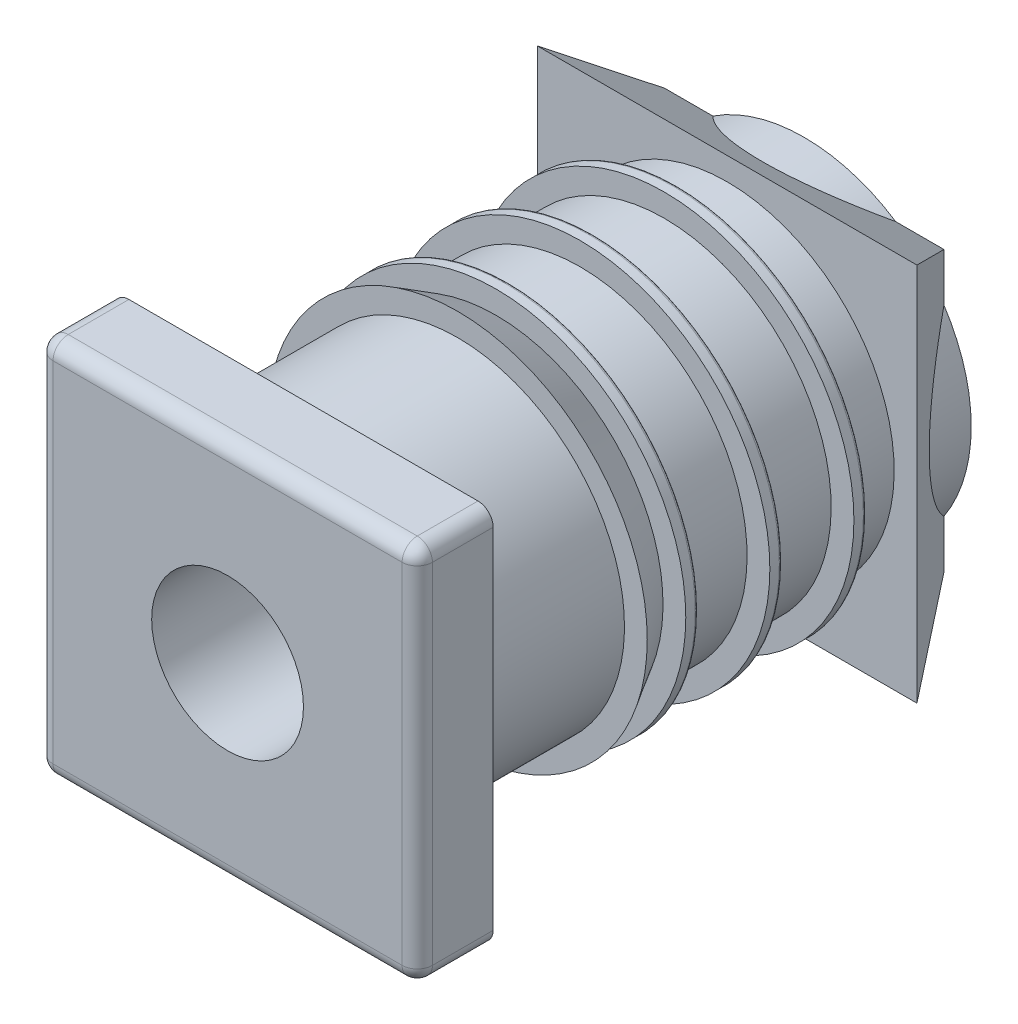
ISO-10303-21;
HEADER;
FILE_DESCRIPTION(('STEP AP214'),'2;1');
FILE_NAME('part.step','',(''),(''),'','','');
FILE_SCHEMA(('AUTOMOTIVE_DESIGN { 1 0 10303 214 1 1 1 1 }'));
ENDSEC;
DATA;
#1=APPLICATION_CONTEXT('core data for automotive mechanical design processes');
#2=APPLICATION_PROTOCOL_DEFINITION('international standard','automotive_design',2000,#1);
#3=PRODUCT_CONTEXT('',#1,'mechanical');
#4=PRODUCT('Part','Part','',(#3));
#5=PRODUCT_RELATED_PRODUCT_CATEGORY('part','',(#4));
#6=PRODUCT_DEFINITION_FORMATION('','',#4);
#7=PRODUCT_DEFINITION_CONTEXT('part definition',#1,'design');
#8=PRODUCT_DEFINITION('design','',#6,#7);
#9=PRODUCT_DEFINITION_SHAPE('','',#8);
#10=(LENGTH_UNIT() NAMED_UNIT(*) SI_UNIT(.MILLI.,.METRE.));
#11=(NAMED_UNIT(*) PLANE_ANGLE_UNIT() SI_UNIT($,.RADIAN.));
#12=(NAMED_UNIT(*) SI_UNIT($,.STERADIAN.) SOLID_ANGLE_UNIT());
#13=UNCERTAINTY_MEASURE_WITH_UNIT(LENGTH_MEASURE(1.E-05),#10,'distance_accuracy_value','');
#14=(GEOMETRIC_REPRESENTATION_CONTEXT(3) GLOBAL_UNCERTAINTY_ASSIGNED_CONTEXT((#13)) GLOBAL_UNIT_ASSIGNED_CONTEXT((#10,
#11,#12)) REPRESENTATION_CONTEXT('',''));
#15=CARTESIAN_POINT('',(0.,0.,0.));
#16=DIRECTION('',(0.,0.,1.));
#17=DIRECTION('',(1.,0.,0.));
#18=AXIS2_PLACEMENT_3D('',#15,#16,#17);
#19=CARTESIAN_POINT('',(-11.65,0.,-19.0565934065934));
#20=DIRECTION('',(0.,0.,-1.));
#21=DIRECTION('',(0.,-1.,0.));
#22=AXIS2_PLACEMENT_3D('',#19,#20,#21);
#23=PLANE('',#22);
#24=CARTESIAN_POINT('',(0.,0.,-19.0565934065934));
#25=DIRECTION('',(0.,0.,1.));
#26=DIRECTION('',(0.,-1.,0.));
#27=AXIS2_PLACEMENT_3D('',#24,#25,#26);
#28=CIRCLE('',#27,12.3);
#29=CARTESIAN_POINT('',(0.,-12.3,-19.0565934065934));
#30=VERTEX_POINT('',#29);
#31=CARTESIAN_POINT('',(0.,12.3,-19.0565934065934));
#32=VERTEX_POINT('',#31);
#33=EDGE_CURVE('E178',#30,#32,#28,.T.);
#34=ORIENTED_EDGE('',*,*,#33,.F.);
#35=CARTESIAN_POINT('',(0.,0.,-19.0565934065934));
#36=DIRECTION('',(0.,0.,1.));
#37=DIRECTION('',(-1.,0.,0.));
#38=AXIS2_PLACEMENT_3D('',#35,#36,#37);
#39=CIRCLE('',#38,12.3);
#40=CARTESIAN_POINT('',(-12.3,0.,-19.0565934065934));
#41=VERTEX_POINT('',#40);
#42=EDGE_CURVE('E171',#41,#30,#39,.T.);
#43=ORIENTED_EDGE('',*,*,#42,.F.);
#44=CARTESIAN_POINT('',(0.,0.,-19.0565934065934));
#45=DIRECTION('',(0.,0.,1.));
#46=DIRECTION('',(0.,1.,0.));
#47=AXIS2_PLACEMENT_3D('',#44,#45,#46);
#48=CIRCLE('',#47,12.3);
#49=EDGE_CURVE('E175',#32,#41,#48,.T.);
#50=ORIENTED_EDGE('',*,*,#49,.F.);
#51=EDGE_LOOP('',(#34,#43,#50));
#52=FACE_BOUND('',#51,.T.);
#53=CARTESIAN_POINT('',(0.,0.,-19.0565934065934));
#54=DIRECTION('',(0.,0.,1.));
#55=DIRECTION('',(0.,1.,0.));
#56=AXIS2_PLACEMENT_3D('',#53,#54,#55);
#57=CIRCLE('',#56,11.);
#58=CARTESIAN_POINT('',(0.,11.,-19.0565934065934));
#59=VERTEX_POINT('',#58);
#60=EDGE_CURVE('E188',#59,#59,#57,.F.);
#61=ORIENTED_EDGE('',*,*,#60,.F.);
#62=EDGE_LOOP('',(#61));
#63=FACE_BOUND('',#62,.T.);
#64=ADVANCED_FACE('F14',(#52,#63),#23,.T.);
#65=CARTESIAN_POINT('',(0.,0.,-21.4137362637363));
#66=DIRECTION('',(0.,0.,1.));
#67=DIRECTION('',(0.,1.,0.));
#68=AXIS2_PLACEMENT_3D('',#65,#66,#67);
#69=CYLINDRICAL_SURFACE('',#68,11.);
#70=CARTESIAN_POINT('',(0.,0.,-23.7708791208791));
#71=DIRECTION('',(0.,0.,1.));
#72=DIRECTION('',(0.,1.,0.));
#73=AXIS2_PLACEMENT_3D('',#70,#71,#72);
#74=CIRCLE('',#73,11.);
#75=CARTESIAN_POINT('',(0.,11.,-23.7708791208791));
#76=VERTEX_POINT('',#75);
#77=EDGE_CURVE('E339',#76,#76,#74,.F.);
#78=ORIENTED_EDGE('',*,*,#77,.F.);
#79=EDGE_LOOP('',(#78));
#80=FACE_BOUND('',#79,.T.);
#81=ORIENTED_EDGE('',*,*,#60,.T.);
#82=EDGE_LOOP('',(#81));
#83=FACE_BOUND('',#82,.T.);
#84=ADVANCED_FACE('F210',(#80,#83),#69,.T.);
#85=CARTESIAN_POINT('',(0.,0.,-18.8565934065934));
#86=DIRECTION('',(0.,0.,-1.));
#87=DIRECTION('',(0.,-1.,0.));
#88=AXIS2_PLACEMENT_3D('',#85,#86,#87);
#89=TOROIDAL_SURFACE('',#88,12.3,0.2);
#90=ORIENTED_EDGE('',*,*,#42,.T.);
#91=ORIENTED_EDGE('',*,*,#33,.T.);
#92=ORIENTED_EDGE('',*,*,#49,.T.);
#93=EDGE_LOOP('',(#90,#91,#92));
#94=FACE_BOUND('',#93,.T.);
#95=CARTESIAN_POINT('',(0.,0.,-18.8565934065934));
#96=DIRECTION('',(0.,0.,1.));
#97=DIRECTION('',(0.,1.,0.));
#98=AXIS2_PLACEMENT_3D('',#95,#96,#97);
#99=CIRCLE('',#98,12.5);
#100=CARTESIAN_POINT('',(0.,12.5,-18.8565934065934));
#101=VERTEX_POINT('',#100);
#102=EDGE_CURVE('E218',#101,#101,#99,.T.);
#103=ORIENTED_EDGE('',*,*,#102,.F.);
#104=EDGE_LOOP('',(#103));
#105=FACE_BOUND('',#104,.T.);
#106=ADVANCED_FACE('F185',(#94,#105),#89,.T.);
#107=CARTESIAN_POINT('',(-11.75,0.,-23.7708791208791));
#108=DIRECTION('',(0.,0.,1.));
#109=DIRECTION('',(0.,1.,0.));
#110=AXIS2_PLACEMENT_3D('',#107,#108,#109);
#111=PLANE('',#110);
#112=ORIENTED_EDGE('',*,*,#77,.T.);
#113=EDGE_LOOP('',(#112));
#114=FACE_BOUND('',#113,.T.);
#115=CARTESIAN_POINT('',(0.,0.,-23.7708791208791));
#116=DIRECTION('',(0.,0.,1.));
#117=DIRECTION('',(0.,1.,0.));
#118=AXIS2_PLACEMENT_3D('',#115,#116,#117);
#119=CIRCLE('',#118,12.5);
#120=CARTESIAN_POINT('',(0.,12.5,-23.7708791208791));
#121=VERTEX_POINT('',#120);
#122=EDGE_CURVE('E336',#121,#121,#119,.F.);
#123=ORIENTED_EDGE('',*,*,#122,.F.);
#124=EDGE_LOOP('',(#123));
#125=FACE_BOUND('',#124,.T.);
#126=ADVANCED_FACE('F209',(#114,#125),#111,.T.);
#127=CARTESIAN_POINT('',(0.,0.,-18.5440934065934));
#128=DIRECTION('',(0.,0.,1.));
#129=DIRECTION('',(0.,1.,0.));
#130=AXIS2_PLACEMENT_3D('',#127,#128,#129);
#131=CYLINDRICAL_SURFACE('',#130,12.5);
#132=ORIENTED_EDGE('',*,*,#102,.T.);
#133=EDGE_LOOP('',(#132));
#134=FACE_BOUND('',#133,.T.);
#135=CARTESIAN_POINT('',(0.,0.,-18.2315934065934));
#136=DIRECTION('',(0.,0.,1.));
#137=DIRECTION('',(0.,1.,0.));
#138=AXIS2_PLACEMENT_3D('',#135,#136,#137);
#139=CIRCLE('',#138,12.5);
#140=CARTESIAN_POINT('',(0.,12.5,-18.2315934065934));
#141=VERTEX_POINT('',#140);
#142=EDGE_CURVE('E333',#141,#141,#139,.T.);
#143=ORIENTED_EDGE('',*,*,#142,.F.);
#144=EDGE_LOOP('',(#143));
#145=FACE_BOUND('',#144,.T.);
#146=ADVANCED_FACE('F482',(#134,#145),#131,.T.);
#147=CARTESIAN_POINT('',(0.,0.,-24.0833791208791));
#148=DIRECTION('',(0.,0.,1.));
#149=DIRECTION('',(0.,1.,0.));
#150=AXIS2_PLACEMENT_3D('',#147,#148,#149);
#151=CYLINDRICAL_SURFACE('',#150,12.5);
#152=ORIENTED_EDGE('',*,*,#122,.T.);
#153=EDGE_LOOP('',(#152));
#154=FACE_BOUND('',#153,.T.);
#155=CARTESIAN_POINT('',(0.,0.,-24.3958791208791));
#156=DIRECTION('',(0.,0.,-1.));
#157=DIRECTION('',(0.,-1.,0.));
#158=AXIS2_PLACEMENT_3D('',#155,#156,#157);
#159=CIRCLE('',#158,12.5);
#160=CARTESIAN_POINT('',(0.,-12.5,-24.3958791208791));
#161=VERTEX_POINT('',#160);
#162=EDGE_CURVE('E332',#161,#161,#159,.T.);
#163=ORIENTED_EDGE('',*,*,#162,.F.);
#164=EDGE_LOOP('',(#163));
#165=FACE_BOUND('',#164,.T.);
#166=ADVANCED_FACE('F480',(#154,#165),#151,.T.);
#167=CARTESIAN_POINT('',(-11.75,0.,-18.2315934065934));
#168=DIRECTION('',(0.,0.,1.));
#169=DIRECTION('',(0.,1.,0.));
#170=AXIS2_PLACEMENT_3D('',#167,#168,#169);
#171=PLANE('',#170);
#172=CARTESIAN_POINT('',(0.,0.,-18.2315934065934));
#173=DIRECTION('',(0.,0.,1.));
#174=DIRECTION('',(0.,1.,0.));
#175=AXIS2_PLACEMENT_3D('',#172,#173,#174);
#176=CIRCLE('',#175,11.);
#177=CARTESIAN_POINT('',(0.,11.,-18.2315934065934));
#178=VERTEX_POINT('',#177);
#179=EDGE_CURVE('E328',#178,#178,#176,.T.);
#180=ORIENTED_EDGE('',*,*,#179,.F.);
#181=EDGE_LOOP('',(#180));
#182=FACE_BOUND('',#181,.T.);
#183=ORIENTED_EDGE('',*,*,#142,.T.);
#184=EDGE_LOOP('',(#183));
#185=FACE_BOUND('',#184,.T.);
#186=ADVANCED_FACE('F460',(#182,#185),#171,.T.);
#187=CARTESIAN_POINT('',(0.,0.,-24.3958791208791));
#188=DIRECTION('',(0.,0.,-1.));
#189=DIRECTION('',(0.,-1.,0.));
#190=AXIS2_PLACEMENT_3D('',#187,#188,#189);
#191=TOROIDAL_SURFACE('',#190,12.3,0.2);
#192=ORIENTED_EDGE('',*,*,#162,.T.);
#193=EDGE_LOOP('',(#192));
#194=FACE_BOUND('',#193,.T.);
#195=CARTESIAN_POINT('',(0.,0.,-24.5958791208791));
#196=DIRECTION('',(0.,0.,1.));
#197=DIRECTION('',(0.,1.,0.));
#198=AXIS2_PLACEMENT_3D('',#195,#196,#197);
#199=CIRCLE('',#198,12.3);
#200=CARTESIAN_POINT('',(-12.3,0.,-24.5958791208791));
#201=VERTEX_POINT('',#200);
#202=CARTESIAN_POINT('',(0.,12.3,-24.5958791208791));
#203=VERTEX_POINT('',#202);
#204=EDGE_CURVE('E331',#201,#203,#199,.F.);
#205=ORIENTED_EDGE('',*,*,#204,.F.);
#206=CARTESIAN_POINT('',(0.,0.,-24.5958791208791));
#207=DIRECTION('',(0.,0.,1.));
#208=DIRECTION('',(-1.,0.,0.));
#209=AXIS2_PLACEMENT_3D('',#206,#207,#208);
#210=CIRCLE('',#209,12.3);
#211=CARTESIAN_POINT('',(0.,-12.3,-24.5958791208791));
#212=VERTEX_POINT('',#211);
#213=EDGE_CURVE('E327',#212,#201,#210,.F.);
#214=ORIENTED_EDGE('',*,*,#213,.F.);
#215=CARTESIAN_POINT('',(0.,0.,-24.5958791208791));
#216=DIRECTION('',(0.,0.,1.));
#217=DIRECTION('',(0.,-1.,0.));
#218=AXIS2_PLACEMENT_3D('',#215,#216,#217);
#219=CIRCLE('',#218,12.3);
#220=EDGE_CURVE('E434',#203,#212,#219,.F.);
#221=ORIENTED_EDGE('',*,*,#220,.F.);
#222=EDGE_LOOP('',(#205,#214,#221));
#223=FACE_BOUND('',#222,.T.);
#224=ADVANCED_FACE('F455',(#194,#223),#191,.T.);
#225=CARTESIAN_POINT('',(0.,0.,-15.8744505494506));
#226=DIRECTION('',(0.,0.,1.));
#227=DIRECTION('',(0.,1.,0.));
#228=AXIS2_PLACEMENT_3D('',#225,#226,#227);
#229=CYLINDRICAL_SURFACE('',#228,11.);
#230=ORIENTED_EDGE('',*,*,#179,.T.);
#231=EDGE_LOOP('',(#230));
#232=FACE_BOUND('',#231,.T.);
#233=CARTESIAN_POINT('',(0.,0.,-13.5173076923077));
#234=DIRECTION('',(0.,0.,1.));
#235=DIRECTION('',(0.,1.,0.));
#236=AXIS2_PLACEMENT_3D('',#233,#234,#235);
#237=CIRCLE('',#236,11.);
#238=CARTESIAN_POINT('',(0.,11.,-13.5173076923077));
#239=VERTEX_POINT('',#238);
#240=EDGE_CURVE('E324',#239,#239,#237,.T.);
#241=ORIENTED_EDGE('',*,*,#240,.F.);
#242=EDGE_LOOP('',(#241));
#243=FACE_BOUND('',#242,.T.);
#244=ADVANCED_FACE('F459',(#232,#243),#229,.T.);
#245=CARTESIAN_POINT('',(-11.65,0.,-24.5958791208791));
#246=DIRECTION('',(0.,0.,-1.));
#247=DIRECTION('',(0.,-1.,0.));
#248=AXIS2_PLACEMENT_3D('',#245,#246,#247);
#249=PLANE('',#248);
#250=ORIENTED_EDGE('',*,*,#220,.T.);
#251=ORIENTED_EDGE('',*,*,#213,.T.);
#252=ORIENTED_EDGE('',*,*,#204,.T.);
#253=EDGE_LOOP('',(#250,#251,#252));
#254=FACE_BOUND('',#253,.T.);
#255=CARTESIAN_POINT('',(0.,0.,-24.5958791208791));
#256=DIRECTION('',(0.,0.,1.));
#257=DIRECTION('',(0.,1.,0.));
#258=AXIS2_PLACEMENT_3D('',#255,#256,#257);
#259=CIRCLE('',#258,11.);
#260=CARTESIAN_POINT('',(0.,11.,-24.5958791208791));
#261=VERTEX_POINT('',#260);
#262=EDGE_CURVE('E320',#261,#261,#259,.F.);
#263=ORIENTED_EDGE('',*,*,#262,.F.);
#264=EDGE_LOOP('',(#263));
#265=FACE_BOUND('',#264,.T.);
#266=ADVANCED_FACE('F392',(#254,#265),#249,.T.);
#267=CARTESIAN_POINT('',(-11.65,0.,-13.5173076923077));
#268=DIRECTION('',(0.,0.,-1.));
#269=DIRECTION('',(0.,-1.,0.));
#270=AXIS2_PLACEMENT_3D('',#267,#268,#269);
#271=PLANE('',#270);
#272=CARTESIAN_POINT('',(0.,0.,-13.5173076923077));
#273=DIRECTION('',(0.,0.,1.));
#274=DIRECTION('',(0.,-1.,0.));
#275=AXIS2_PLACEMENT_3D('',#272,#273,#274);
#276=CIRCLE('',#275,12.3);
#277=CARTESIAN_POINT('',(0.,-12.3,-13.5173076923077));
#278=VERTEX_POINT('',#277);
#279=CARTESIAN_POINT('',(0.,12.3,-13.5173076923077));
#280=VERTEX_POINT('',#279);
#281=EDGE_CURVE('E319',#278,#280,#276,.T.);
#282=ORIENTED_EDGE('',*,*,#281,.F.);
#283=CARTESIAN_POINT('',(0.,0.,-13.5173076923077));
#284=DIRECTION('',(0.,0.,1.));
#285=DIRECTION('',(-1.,0.,0.));
#286=AXIS2_PLACEMENT_3D('',#283,#284,#285);
#287=CIRCLE('',#286,12.3);
#288=CARTESIAN_POINT('',(-12.3,0.,-13.5173076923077));
#289=VERTEX_POINT('',#288);
#290=EDGE_CURVE('E409',#289,#278,#287,.T.);
#291=ORIENTED_EDGE('',*,*,#290,.F.);
#292=CARTESIAN_POINT('',(0.,0.,-13.5173076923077));
#293=DIRECTION('',(0.,0.,1.));
#294=DIRECTION('',(0.,1.,0.));
#295=AXIS2_PLACEMENT_3D('',#292,#293,#294);
#296=CIRCLE('',#295,12.3);
#297=EDGE_CURVE('E323',#280,#289,#296,.T.);
#298=ORIENTED_EDGE('',*,*,#297,.F.);
#299=EDGE_LOOP('',(#282,#291,#298));
#300=FACE_BOUND('',#299,.T.);
#301=ORIENTED_EDGE('',*,*,#240,.T.);
#302=EDGE_LOOP('',(#301));
#303=FACE_BOUND('',#302,.T.);
#304=ADVANCED_FACE('F383',(#300,#303),#271,.T.);
#305=CARTESIAN_POINT('',(0.,0.,-28.7979395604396));
#306=DIRECTION('',(0.,0.,1.));
#307=DIRECTION('',(0.,1.,0.));
#308=AXIS2_PLACEMENT_3D('',#305,#306,#307);
#309=CYLINDRICAL_SURFACE('',#308,11.);
#310=ORIENTED_EDGE('',*,*,#262,.T.);
#311=EDGE_LOOP('',(#310));
#312=FACE_BOUND('',#311,.T.);
#313=CARTESIAN_POINT('',(0.,0.,-27.9230769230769));
#314=DIRECTION('',(0.,0.,1.));
#315=DIRECTION('',(0.,1.,0.));
#316=AXIS2_PLACEMENT_3D('',#313,#314,#315);
#317=CIRCLE('',#316,11.);
#318=CARTESIAN_POINT('',(0.,11.,-27.9230769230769));
#319=VERTEX_POINT('',#318);
#320=EDGE_CURVE('E315',#319,#319,#317,.F.);
#321=ORIENTED_EDGE('',*,*,#320,.F.);
#322=EDGE_LOOP('',(#321));
#323=FACE_BOUND('',#322,.T.);
#324=ADVANCED_FACE('F366',(#312,#323),#309,.T.);
#325=CARTESIAN_POINT('',(0.,0.,-13.3173076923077));
#326=DIRECTION('',(0.,0.,-1.));
#327=DIRECTION('',(0.,-1.,0.));
#328=AXIS2_PLACEMENT_3D('',#325,#326,#327);
#329=TOROIDAL_SURFACE('',#328,12.3,0.2);
#330=ORIENTED_EDGE('',*,*,#290,.T.);
#331=ORIENTED_EDGE('',*,*,#281,.T.);
#332=ORIENTED_EDGE('',*,*,#297,.T.);
#333=EDGE_LOOP('',(#330,#331,#332));
#334=FACE_BOUND('',#333,.T.);
#335=CARTESIAN_POINT('',(0.,0.,-13.3173076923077));
#336=DIRECTION('',(0.,0.,1.));
#337=DIRECTION('',(0.,1.,0.));
#338=AXIS2_PLACEMENT_3D('',#335,#336,#337);
#339=CIRCLE('',#338,12.5);
#340=CARTESIAN_POINT('',(0.,12.5,-13.3173076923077));
#341=VERTEX_POINT('',#340);
#342=EDGE_CURVE('E318',#341,#341,#339,.T.);
#343=ORIENTED_EDGE('',*,*,#342,.F.);
#344=EDGE_LOOP('',(#343));
#345=FACE_BOUND('',#344,.T.);
#346=ADVANCED_FACE('F354',(#334,#345),#329,.T.);
#347=CARTESIAN_POINT('',(12.5,-12.5,-27.9230769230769));
#348=DIRECTION('',(0.,0.,1.));
#349=DIRECTION('',(0.,1.,0.));
#350=AXIS2_PLACEMENT_3D('',#347,#348,#349);
#351=PLANE('',#350);
#352=DIRECTION('',(-1.,0.,0.));
#353=VECTOR('',#352,1.);
#354=CARTESIAN_POINT('',(-12.5,-12.5,-27.9230769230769));
#355=LINE('',#354,#353);
#356=CARTESIAN_POINT('',(-12.5,-12.5,-27.9230769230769));
#357=VERTEX_POINT('',#356);
#358=CARTESIAN_POINT('',(12.5,-12.5,-27.9230769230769));
#359=VERTEX_POINT('',#358);
#360=EDGE_CURVE('E314',#357,#359,#355,.F.);
#361=ORIENTED_EDGE('',*,*,#360,.T.);
#362=DIRECTION('',(0.,-1.,0.));
#363=VECTOR('',#362,1.);
#364=CARTESIAN_POINT('',(12.5,-12.5,-27.9230769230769));
#365=LINE('',#364,#363);
#366=CARTESIAN_POINT('',(12.5,12.5,-27.9230769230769));
#367=VERTEX_POINT('',#366);
#368=EDGE_CURVE('E621',#367,#359,#365,.T.);
#369=ORIENTED_EDGE('',*,*,#368,.F.);
#370=DIRECTION('',(-1.,0.,0.));
#371=VECTOR('',#370,1.);
#372=CARTESIAN_POINT('',(-12.5,12.5,-27.9230769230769));
#373=LINE('',#372,#371);
#374=CARTESIAN_POINT('',(-12.5,12.5,-27.9230769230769));
#375=VERTEX_POINT('',#374);
#376=EDGE_CURVE('E623',#367,#375,#373,.T.);
#377=ORIENTED_EDGE('',*,*,#376,.T.);
#378=DIRECTION('',(0.,-1.,0.));
#379=VECTOR('',#378,1.);
#380=CARTESIAN_POINT('',(-12.5,-12.5,-27.9230769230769));
#381=LINE('',#380,#379);
#382=EDGE_CURVE('E624',#357,#375,#381,.F.);
#383=ORIENTED_EDGE('',*,*,#382,.F.);
#384=EDGE_LOOP('',(#361,#369,#377,#383));
#385=FACE_BOUND('',#384,.T.);
#386=ORIENTED_EDGE('',*,*,#320,.T.);
#387=EDGE_LOOP('',(#386));
#388=FACE_BOUND('',#387,.T.);
#389=ADVANCED_FACE('F365',(#385,#388),#351,.T.);
#390=CARTESIAN_POINT('',(0.,0.,-13.0048076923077));
#391=DIRECTION('',(0.,0.,1.));
#392=DIRECTION('',(0.,1.,0.));
#393=AXIS2_PLACEMENT_3D('',#390,#391,#392);
#394=CYLINDRICAL_SURFACE('',#393,12.5);
#395=ORIENTED_EDGE('',*,*,#342,.T.);
#396=EDGE_LOOP('',(#395));
#397=FACE_BOUND('',#396,.T.);
#398=CARTESIAN_POINT('',(0.,0.,-12.6923076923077));
#399=DIRECTION('',(0.,0.,1.));
#400=DIRECTION('',(0.,1.,0.));
#401=AXIS2_PLACEMENT_3D('',#398,#399,#400);
#402=CIRCLE('',#401,12.5);
#403=CARTESIAN_POINT('',(0.,12.5,-12.6923076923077));
#404=VERTEX_POINT('',#403);
#405=EDGE_CURVE('E298',#404,#404,#402,.T.);
#406=ORIENTED_EDGE('',*,*,#405,.F.);
#407=EDGE_LOOP('',(#406));
#408=FACE_BOUND('',#407,.T.);
#409=ADVANCED_FACE('F602',(#397,#408),#394,.T.);
#410=CARTESIAN_POINT('',(0.,0.,-28.7979395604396));
#411=DIRECTION('',(0.,0.,1.));
#412=DIRECTION('',(0.,1.,0.));
#413=AXIS2_PLACEMENT_3D('',#410,#411,#412);
#414=CYLINDRICAL_SURFACE('',#413,11.);
#415=CARTESIAN_POINT('',(0.,0.,-47.1713889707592));
#416=DIRECTION('',(0.,0.838670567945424,0.544639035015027));
#417=DIRECTION('',(0.,-0.544639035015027,0.838670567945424));
#418=AXIS2_PLACEMENT_3D('',#415,#416,#417);
#419=ELLIPSE('',#418,20.1968630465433,11.);
#420=CARTESIAN_POINT('',(6.02533410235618,-9.20300760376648,-33.));
#421=VERTEX_POINT('',#420);
#422=CARTESIAN_POINT('',(-6.02533410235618,-9.20300760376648,-33.));
#423=VERTEX_POINT('',#422);
#424=EDGE_CURVE('E120',#421,#423,#419,.F.);
#425=ORIENTED_EDGE('',*,*,#424,.T.);
#426=CARTESIAN_POINT('',(0.,0.,-33.));
#427=DIRECTION('',(0.,0.,1.));
#428=DIRECTION('',(0.,1.,0.));
#429=AXIS2_PLACEMENT_3D('',#426,#427,#428);
#430=CIRCLE('',#429,11.);
#431=EDGE_CURVE('E293',#421,#423,#430,.F.);
#432=ORIENTED_EDGE('',*,*,#431,.F.);
#433=EDGE_LOOP('',(#425,#432));
#434=FACE_BOUND('',#433,.T.);
#435=ADVANCED_FACE('F600',(#434),#414,.T.);
#436=CARTESIAN_POINT('',(-12.5,-12.5,-27.9230769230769));
#437=DIRECTION('',(0.,0.838670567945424,0.544639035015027));
#438=DIRECTION('',(0.,0.544639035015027,-0.838670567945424));
#439=AXIS2_PLACEMENT_3D('',#436,#437,#438);
#440=PLANE('',#439);
#441=DIRECTION('',(-1.,0.,0.));
#442=VECTOR('',#441,1.);
#443=CARTESIAN_POINT('',(-9.20300760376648,-9.20300760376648,-33.));
#444=LINE('',#443,#442);
#445=CARTESIAN_POINT('',(9.20300760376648,-9.20300760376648,-33.));
#446=VERTEX_POINT('',#445);
#447=EDGE_CURVE('E297',#446,#421,#444,.T.);
#448=ORIENTED_EDGE('',*,*,#447,.F.);
#449=DIRECTION('',(-0.47830007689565,0.478300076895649,-0.736517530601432));
#450=VECTOR('',#449,1.);
#451=CARTESIAN_POINT('',(12.5,-12.5,-27.9230769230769));
#452=LINE('',#451,#450);
#453=EDGE_CURVE('E127',#359,#446,#452,.T.);
#454=ORIENTED_EDGE('',*,*,#453,.F.);
#455=ORIENTED_EDGE('',*,*,#360,.F.);
#456=DIRECTION('',(-0.47830007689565,-0.478300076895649,0.736517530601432));
#457=VECTOR('',#456,1.);
#458=CARTESIAN_POINT('',(-9.20300760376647,-9.20300760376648,-33.));
#459=LINE('',#458,#457);
#460=CARTESIAN_POINT('',(-9.20300760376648,-9.20300760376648,-33.));
#461=VERTEX_POINT('',#460);
#462=EDGE_CURVE('E312',#461,#357,#459,.T.);
#463=ORIENTED_EDGE('',*,*,#462,.F.);
#464=DIRECTION('',(-1.,0.,0.));
#465=VECTOR('',#464,1.);
#466=CARTESIAN_POINT('',(-9.20300760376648,-9.20300760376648,-33.));
#467=LINE('',#466,#465);
#468=EDGE_CURVE('E296',#423,#461,#467,.T.);
#469=ORIENTED_EDGE('',*,*,#468,.F.);
#470=ORIENTED_EDGE('',*,*,#424,.F.);
#471=EDGE_LOOP('',(#448,#454,#455,#463,#469,#470));
#472=FACE_BOUND('',#471,.T.);
#473=ADVANCED_FACE('F596',(#472),#440,.F.);
#474=CARTESIAN_POINT('',(0.,0.,-28.7979395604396));
#475=DIRECTION('',(0.,0.,1.));
#476=DIRECTION('',(0.,1.,0.));
#477=AXIS2_PLACEMENT_3D('',#474,#475,#476);
#478=CYLINDRICAL_SURFACE('',#477,11.);
#479=CARTESIAN_POINT('',(0.,0.,-47.1713889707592));
#480=DIRECTION('',(-0.838670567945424,0.,-0.544639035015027));
#481=DIRECTION('',(-0.544639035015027,0.,0.838670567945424));
#482=AXIS2_PLACEMENT_3D('',#479,#480,#481);
#483=ELLIPSE('',#482,20.1968630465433,11.);
#484=CARTESIAN_POINT('',(-9.20300760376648,6.02533410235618,-33.));
#485=VERTEX_POINT('',#484);
#486=CARTESIAN_POINT('',(-9.20300760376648,-6.02533410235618,-33.));
#487=VERTEX_POINT('',#486);
#488=EDGE_CURVE('E309',#485,#487,#483,.F.);
#489=ORIENTED_EDGE('',*,*,#488,.F.);
#490=CARTESIAN_POINT('',(0.,0.,-33.));
#491=DIRECTION('',(0.,0.,1.));
#492=DIRECTION('',(0.,1.,0.));
#493=AXIS2_PLACEMENT_3D('',#490,#491,#492);
#494=CIRCLE('',#493,11.);
#495=EDGE_CURVE('E288',#487,#485,#494,.F.);
#496=ORIENTED_EDGE('',*,*,#495,.F.);
#497=EDGE_LOOP('',(#489,#496));
#498=FACE_BOUND('',#497,.T.);
#499=ADVANCED_FACE('F592',(#498),#478,.T.);
#500=CARTESIAN_POINT('',(-12.5,-12.5,-27.9230769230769));
#501=DIRECTION('',(-0.838670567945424,0.,-0.544639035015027));
#502=DIRECTION('',(0.544639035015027,0.,-0.838670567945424));
#503=AXIS2_PLACEMENT_3D('',#500,#501,#502);
#504=PLANE('',#503);
#505=DIRECTION('',(0.478300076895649,-0.47830007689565,-0.736517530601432));
#506=VECTOR('',#505,1.);
#507=CARTESIAN_POINT('',(-12.5,12.5,-27.9230769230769));
#508=LINE('',#507,#506);
#509=CARTESIAN_POINT('',(-9.20300760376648,9.20300760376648,-33.));
#510=VERTEX_POINT('',#509);
#511=EDGE_CURVE('E308',#375,#510,#508,.T.);
#512=ORIENTED_EDGE('',*,*,#511,.T.);
#513=DIRECTION('',(0.,-1.,0.));
#514=VECTOR('',#513,1.);
#515=CARTESIAN_POINT('',(-9.20300760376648,-12.5,-33.));
#516=LINE('',#515,#514);
#517=EDGE_CURVE('E291',#485,#510,#516,.F.);
#518=ORIENTED_EDGE('',*,*,#517,.F.);
#519=ORIENTED_EDGE('',*,*,#488,.T.);
#520=DIRECTION('',(0.,-1.,0.));
#521=VECTOR('',#520,1.);
#522=CARTESIAN_POINT('',(-9.20300760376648,-12.5,-33.));
#523=LINE('',#522,#521);
#524=EDGE_CURVE('E292',#461,#487,#523,.F.);
#525=ORIENTED_EDGE('',*,*,#524,.F.);
#526=ORIENTED_EDGE('',*,*,#462,.T.);
#527=ORIENTED_EDGE('',*,*,#382,.T.);
#528=EDGE_LOOP('',(#512,#518,#519,#525,#526,#527));
#529=FACE_BOUND('',#528,.T.);
#530=ADVANCED_FACE('F588',(#529),#504,.T.);
#531=CARTESIAN_POINT('',(0.,0.,-28.7979395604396));
#532=DIRECTION('',(0.,0.,1.));
#533=DIRECTION('',(0.,1.,0.));
#534=AXIS2_PLACEMENT_3D('',#531,#532,#533);
#535=CYLINDRICAL_SURFACE('',#534,11.);
#536=CARTESIAN_POINT('',(0.,0.,-47.1713889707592));
#537=DIRECTION('',(0.,-0.838670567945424,0.544639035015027));
#538=DIRECTION('',(0.,0.544639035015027,0.838670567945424));
#539=AXIS2_PLACEMENT_3D('',#536,#537,#538);
#540=ELLIPSE('',#539,20.1968630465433,11.);
#541=CARTESIAN_POINT('',(-6.02533410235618,9.20300760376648,-33.));
#542=VERTEX_POINT('',#541);
#543=CARTESIAN_POINT('',(6.02533410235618,9.20300760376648,-33.));
#544=VERTEX_POINT('',#543);
#545=EDGE_CURVE('E305',#542,#544,#540,.F.);
#546=ORIENTED_EDGE('',*,*,#545,.T.);
#547=CARTESIAN_POINT('',(0.,0.,-33.));
#548=DIRECTION('',(0.,0.,1.));
#549=DIRECTION('',(0.,1.,0.));
#550=AXIS2_PLACEMENT_3D('',#547,#548,#549);
#551=CIRCLE('',#550,11.);
#552=EDGE_CURVE('E283',#542,#544,#551,.F.);
#553=ORIENTED_EDGE('',*,*,#552,.F.);
#554=EDGE_LOOP('',(#546,#553));
#555=FACE_BOUND('',#554,.T.);
#556=ADVANCED_FACE('F584',(#555),#535,.T.);
#557=CARTESIAN_POINT('',(-12.5,9.20300760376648,-33.));
#558=DIRECTION('',(0.,-0.838670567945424,0.544639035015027));
#559=DIRECTION('',(0.,0.544639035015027,0.838670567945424));
#560=AXIS2_PLACEMENT_3D('',#557,#558,#559);
#561=PLANE('',#560);
#562=DIRECTION('',(-1.,0.,0.));
#563=VECTOR('',#562,1.);
#564=CARTESIAN_POINT('',(-9.20300760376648,9.20300760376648,-33.));
#565=LINE('',#564,#563);
#566=EDGE_CURVE('E287',#510,#542,#565,.F.);
#567=ORIENTED_EDGE('',*,*,#566,.F.);
#568=ORIENTED_EDGE('',*,*,#511,.F.);
#569=ORIENTED_EDGE('',*,*,#376,.F.);
#570=DIRECTION('',(0.47830007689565,0.478300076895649,0.736517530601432));
#571=VECTOR('',#570,1.);
#572=CARTESIAN_POINT('',(9.20300760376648,9.20300760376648,-33.));
#573=LINE('',#572,#571);
#574=CARTESIAN_POINT('',(9.20300760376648,9.20300760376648,-33.));
#575=VERTEX_POINT('',#574);
#576=EDGE_CURVE('E307',#575,#367,#573,.T.);
#577=ORIENTED_EDGE('',*,*,#576,.F.);
#578=DIRECTION('',(-1.,0.,0.));
#579=VECTOR('',#578,1.);
#580=CARTESIAN_POINT('',(-9.20300760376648,9.20300760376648,-33.));
#581=LINE('',#580,#579);
#582=EDGE_CURVE('E286',#544,#575,#581,.F.);
#583=ORIENTED_EDGE('',*,*,#582,.F.);
#584=ORIENTED_EDGE('',*,*,#545,.F.);
#585=EDGE_LOOP('',(#567,#568,#569,#577,#583,#584));
#586=FACE_BOUND('',#585,.T.);
#587=ADVANCED_FACE('F581',(#586),#561,.F.);
#588=CARTESIAN_POINT('',(9.20300760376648,-12.5,-33.));
#589=DIRECTION('',(0.838670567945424,0.,-0.544639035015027));
#590=DIRECTION('',(0.544639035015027,0.,0.838670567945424));
#591=AXIS2_PLACEMENT_3D('',#588,#589,#590);
#592=PLANE('',#591);
#593=ORIENTED_EDGE('',*,*,#453,.T.);
#594=DIRECTION('',(0.,-1.,0.));
#595=VECTOR('',#594,1.);
#596=CARTESIAN_POINT('',(9.20300760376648,-12.5,-33.));
#597=LINE('',#596,#595);
#598=CARTESIAN_POINT('',(9.20300760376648,-6.02533410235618,-33.));
#599=VERTEX_POINT('',#598);
#600=EDGE_CURVE('E301',#599,#446,#597,.T.);
#601=ORIENTED_EDGE('',*,*,#600,.F.);
#602=CARTESIAN_POINT('',(0.,0.,-47.1713889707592));
#603=DIRECTION('',(0.838670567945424,0.,-0.544639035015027));
#604=DIRECTION('',(0.544639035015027,0.,0.838670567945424));
#605=AXIS2_PLACEMENT_3D('',#602,#603,#604);
#606=ELLIPSE('',#605,20.1968630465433,11.);
#607=CARTESIAN_POINT('',(9.20300760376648,6.02533410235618,-33.));
#608=VERTEX_POINT('',#607);
#609=EDGE_CURVE('E302',#608,#599,#606,.T.);
#610=ORIENTED_EDGE('',*,*,#609,.F.);
#611=DIRECTION('',(0.,-1.,0.));
#612=VECTOR('',#611,1.);
#613=CARTESIAN_POINT('',(9.20300760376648,-12.5,-33.));
#614=LINE('',#613,#612);
#615=EDGE_CURVE('E282',#575,#608,#614,.T.);
#616=ORIENTED_EDGE('',*,*,#615,.F.);
#617=ORIENTED_EDGE('',*,*,#576,.T.);
#618=ORIENTED_EDGE('',*,*,#368,.T.);
#619=EDGE_LOOP('',(#593,#601,#610,#616,#617,#618));
#620=FACE_BOUND('',#619,.T.);
#621=ADVANCED_FACE('F577',(#620),#592,.T.);
#622=CARTESIAN_POINT('',(0.,0.,-28.7979395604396));
#623=DIRECTION('',(0.,0.,1.));
#624=DIRECTION('',(0.,1.,0.));
#625=AXIS2_PLACEMENT_3D('',#622,#623,#624);
#626=CYLINDRICAL_SURFACE('',#625,11.);
#627=ORIENTED_EDGE('',*,*,#609,.T.);
#628=CARTESIAN_POINT('',(0.,0.,-33.));
#629=DIRECTION('',(0.,0.,1.));
#630=DIRECTION('',(0.,1.,0.));
#631=AXIS2_PLACEMENT_3D('',#628,#629,#630);
#632=CIRCLE('',#631,11.);
#633=EDGE_CURVE('E279',#608,#599,#632,.F.);
#634=ORIENTED_EDGE('',*,*,#633,.F.);
#635=EDGE_LOOP('',(#627,#634));
#636=FACE_BOUND('',#635,.T.);
#637=ADVANCED_FACE('F573',(#636),#626,.T.);
#638=CARTESIAN_POINT('',(-11.75,0.,-12.6923076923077));
#639=DIRECTION('',(0.,0.,1.));
#640=DIRECTION('',(0.,1.,0.));
#641=AXIS2_PLACEMENT_3D('',#638,#639,#640);
#642=PLANE('',#641);
#643=CARTESIAN_POINT('',(0.,0.,-12.6923076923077));
#644=DIRECTION('',(0.,0.,1.));
#645=DIRECTION('',(0.,1.,0.));
#646=AXIS2_PLACEMENT_3D('',#643,#644,#645);
#647=CIRCLE('',#646,11.);
#648=CARTESIAN_POINT('',(0.,11.,-12.6923076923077));
#649=VERTEX_POINT('',#648);
#650=EDGE_CURVE('E276',#649,#649,#647,.T.);
#651=ORIENTED_EDGE('',*,*,#650,.F.);
#652=EDGE_LOOP('',(#651));
#653=FACE_BOUND('',#652,.T.);
#654=ORIENTED_EDGE('',*,*,#405,.T.);
#655=EDGE_LOOP('',(#654));
#656=FACE_BOUND('',#655,.T.);
#657=ADVANCED_FACE('F569',(#653,#656),#642,.T.);
#658=CARTESIAN_POINT('',(-9.20300760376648,-12.5,-33.));
#659=DIRECTION('',(0.,0.,-1.));
#660=DIRECTION('',(0.,-1.,0.));
#661=AXIS2_PLACEMENT_3D('',#658,#659,#660);
#662=PLANE('',#661);
#663=ORIENTED_EDGE('',*,*,#615,.T.);
#664=ORIENTED_EDGE('',*,*,#633,.T.);
#665=ORIENTED_EDGE('',*,*,#600,.T.);
#666=ORIENTED_EDGE('',*,*,#447,.T.);
#667=ORIENTED_EDGE('',*,*,#431,.T.);
#668=ORIENTED_EDGE('',*,*,#468,.T.);
#669=ORIENTED_EDGE('',*,*,#524,.T.);
#670=ORIENTED_EDGE('',*,*,#495,.T.);
#671=ORIENTED_EDGE('',*,*,#517,.T.);
#672=ORIENTED_EDGE('',*,*,#566,.T.);
#673=ORIENTED_EDGE('',*,*,#552,.T.);
#674=ORIENTED_EDGE('',*,*,#582,.T.);
#675=EDGE_LOOP('',(#663,#664,#665,#666,#667,#668,#669,#670,#671,#672,#673,#674));
#676=FACE_BOUND('',#675,.T.);
#677=CARTESIAN_POINT('',(0.,0.,-33.));
#678=DIRECTION('',(0.,0.,-1.));
#679=DIRECTION('',(0.,-1.,0.));
#680=AXIS2_PLACEMENT_3D('',#677,#678,#679);
#681=CIRCLE('',#680,5.);
#682=CARTESIAN_POINT('',(0.,-5.,-33.));
#683=VERTEX_POINT('',#682);
#684=EDGE_CURVE('E709',#683,#683,#681,.T.);
#685=ORIENTED_EDGE('',*,*,#684,.F.);
#686=EDGE_LOOP('',(#685));
#687=FACE_BOUND('',#686,.T.);
#688=ADVANCED_FACE('F565',(#676,#687),#662,.T.);
#689=CARTESIAN_POINT('',(0.,0.,-10.1538461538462));
#690=DIRECTION('',(0.,0.,1.));
#691=DIRECTION('',(0.,1.,0.));
#692=AXIS2_PLACEMENT_3D('',#689,#690,#691);
#693=CONICAL_SURFACE('',#692,12.5,0.533708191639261);
#694=ORIENTED_EDGE('',*,*,#650,.T.);
#695=EDGE_LOOP('',(#694));
#696=FACE_BOUND('',#695,.T.);
#697=CARTESIAN_POINT('',(0.,0.,-10.1538461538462));
#698=DIRECTION('',(0.,0.,1.));
#699=DIRECTION('',(0.,1.,0.));
#700=AXIS2_PLACEMENT_3D('',#697,#698,#699);
#701=CIRCLE('',#700,12.5);
#702=CARTESIAN_POINT('',(0.,12.5,-10.1538461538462));
#703=VERTEX_POINT('',#702);
#704=EDGE_CURVE('E273',#703,#703,#701,.T.);
#705=ORIENTED_EDGE('',*,*,#704,.F.);
#706=EDGE_LOOP('',(#705));
#707=FACE_BOUND('',#706,.T.);
#708=ADVANCED_FACE('F561',(#696,#707),#693,.T.);
#709=CARTESIAN_POINT('',(-11.75,0.,-10.1538461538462));
#710=DIRECTION('',(0.,0.,1.));
#711=DIRECTION('',(0.,1.,0.));
#712=AXIS2_PLACEMENT_3D('',#709,#710,#711);
#713=PLANE('',#712);
#714=CARTESIAN_POINT('',(0.,0.,-10.1538461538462));
#715=DIRECTION('',(0.,0.,1.));
#716=DIRECTION('',(0.,1.,0.));
#717=AXIS2_PLACEMENT_3D('',#714,#715,#716);
#718=CIRCLE('',#717,11.);
#719=CARTESIAN_POINT('',(0.,11.,-10.1538461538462));
#720=VERTEX_POINT('',#719);
#721=EDGE_CURVE('E270',#720,#720,#718,.T.);
#722=ORIENTED_EDGE('',*,*,#721,.F.);
#723=EDGE_LOOP('',(#722));
#724=FACE_BOUND('',#723,.T.);
#725=ORIENTED_EDGE('',*,*,#704,.T.);
#726=EDGE_LOOP('',(#725));
#727=FACE_BOUND('',#726,.T.);
#728=ADVANCED_FACE('F557',(#724,#727),#713,.T.);
#729=CARTESIAN_POINT('',(0.,0.,-2.57692307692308));
#730=DIRECTION('',(0.,0.,1.));
#731=DIRECTION('',(0.,1.,0.));
#732=AXIS2_PLACEMENT_3D('',#729,#730,#731);
#733=CYLINDRICAL_SURFACE('',#732,11.);
#734=CARTESIAN_POINT('',(0.,0.,0.));
#735=DIRECTION('',(0.,0.,1.));
#736=DIRECTION('',(0.,1.,0.));
#737=AXIS2_PLACEMENT_3D('',#734,#735,#736);
#738=CIRCLE('',#737,11.);
#739=CARTESIAN_POINT('',(0.,11.,0.));
#740=VERTEX_POINT('',#739);
#741=EDGE_CURVE('E261',#740,#740,#738,.T.);
#742=ORIENTED_EDGE('',*,*,#741,.F.);
#743=EDGE_LOOP('',(#742));
#744=FACE_BOUND('',#743,.T.);
#745=ORIENTED_EDGE('',*,*,#721,.T.);
#746=EDGE_LOOP('',(#745));
#747=FACE_BOUND('',#746,.T.);
#748=ADVANCED_FACE('F553',(#744,#747),#733,.T.);
#749=CARTESIAN_POINT('',(11.5,-11.5,5.));
#750=DIRECTION('',(0.,0.,1.));
#751=DIRECTION('',(0.,1.,0.));
#752=AXIS2_PLACEMENT_3D('',#749,#750,#751);
#753=CYLINDRICAL_SURFACE('',#752,1.);
#754=DIRECTION('',(0.,0.,-1.));
#755=VECTOR('',#754,1.);
#756=CARTESIAN_POINT('',(12.5,-11.5,5.));
#757=LINE('',#756,#755);
#758=CARTESIAN_POINT('',(12.5,-11.5,4.));
#759=VERTEX_POINT('',#758);
#760=CARTESIAN_POINT('',(12.5,-11.5,0.));
#761=VERTEX_POINT('',#760);
#762=EDGE_CURVE('E657',#759,#761,#757,.T.);
#763=ORIENTED_EDGE('',*,*,#762,.F.);
#764=CARTESIAN_POINT('',(11.5,-11.5,4.));
#765=DIRECTION('',(0.,0.,1.));
#766=DIRECTION('',(0.,1.,0.));
#767=AXIS2_PLACEMENT_3D('',#764,#765,#766);
#768=CIRCLE('',#767,1.);
#769=CARTESIAN_POINT('',(11.5,-12.5,4.));
#770=VERTEX_POINT('',#769);
#771=EDGE_CURVE('E9',#759,#770,#768,.F.);
#772=ORIENTED_EDGE('',*,*,#771,.T.);
#773=DIRECTION('',(0.,0.,-1.));
#774=VECTOR('',#773,1.);
#775=CARTESIAN_POINT('',(11.5,-12.5,5.));
#776=LINE('',#775,#774);
#777=CARTESIAN_POINT('',(11.5,-12.5,0.));
#778=VERTEX_POINT('',#777);
#779=EDGE_CURVE('E652',#778,#770,#776,.F.);
#780=ORIENTED_EDGE('',*,*,#779,.F.);
#781=CARTESIAN_POINT('',(11.5,-11.5,0.));
#782=DIRECTION('',(0.,0.,1.));
#783=DIRECTION('',(0.,1.,0.));
#784=AXIS2_PLACEMENT_3D('',#781,#782,#783);
#785=CIRCLE('',#784,1.);
#786=EDGE_CURVE('E266',#761,#778,#785,.F.);
#787=ORIENTED_EDGE('',*,*,#786,.F.);
#788=EDGE_LOOP('',(#763,#772,#780,#787));
#789=FACE_BOUND('',#788,.T.);
#790=ADVANCED_FACE('F549',(#789),#753,.T.);
#791=CARTESIAN_POINT('',(11.5,11.5,5.));
#792=DIRECTION('',(0.,0.,1.));
#793=DIRECTION('',(0.,1.,0.));
#794=AXIS2_PLACEMENT_3D('',#791,#792,#793);
#795=CYLINDRICAL_SURFACE('',#794,1.);
#796=DIRECTION('',(0.,0.,-1.));
#797=VECTOR('',#796,1.);
#798=CARTESIAN_POINT('',(11.5,12.5,5.));
#799=LINE('',#798,#797);
#800=CARTESIAN_POINT('',(11.5,12.5,4.));
#801=VERTEX_POINT('',#800);
#802=CARTESIAN_POINT('',(11.5,12.5,0.));
#803=VERTEX_POINT('',#802);
#804=EDGE_CURVE('E662',#801,#803,#799,.T.);
#805=ORIENTED_EDGE('',*,*,#804,.F.);
#806=CARTESIAN_POINT('',(11.5,11.5,4.));
#807=DIRECTION('',(0.,0.,1.));
#808=DIRECTION('',(0.,1.,0.));
#809=AXIS2_PLACEMENT_3D('',#806,#807,#808);
#810=CIRCLE('',#809,1.);
#811=CARTESIAN_POINT('',(12.5,11.5,4.));
#812=VERTEX_POINT('',#811);
#813=EDGE_CURVE('E740',#801,#812,#810,.F.);
#814=ORIENTED_EDGE('',*,*,#813,.T.);
#815=DIRECTION('',(0.,0.,-1.));
#816=VECTOR('',#815,1.);
#817=CARTESIAN_POINT('',(12.5,11.5,5.));
#818=LINE('',#817,#816);
#819=CARTESIAN_POINT('',(12.5,11.5,0.));
#820=VERTEX_POINT('',#819);
#821=EDGE_CURVE('E656',#820,#812,#818,.F.);
#822=ORIENTED_EDGE('',*,*,#821,.F.);
#823=CARTESIAN_POINT('',(11.5,11.5,0.));
#824=DIRECTION('',(0.,0.,1.));
#825=DIRECTION('',(0.,1.,0.));
#826=AXIS2_PLACEMENT_3D('',#823,#824,#825);
#827=CIRCLE('',#826,1.);
#828=EDGE_CURVE('E268',#803,#820,#827,.F.);
#829=ORIENTED_EDGE('',*,*,#828,.F.);
#830=EDGE_LOOP('',(#805,#814,#822,#829));
#831=FACE_BOUND('',#830,.T.);
#832=ADVANCED_FACE('F545',(#831),#795,.T.);
#833=CARTESIAN_POINT('',(-11.5,11.5,5.));
#834=DIRECTION('',(0.,0.,1.));
#835=DIRECTION('',(0.,1.,0.));
#836=AXIS2_PLACEMENT_3D('',#833,#834,#835);
#837=CYLINDRICAL_SURFACE('',#836,1.);
#838=DIRECTION('',(0.,0.,-1.));
#839=VECTOR('',#838,1.);
#840=CARTESIAN_POINT('',(-12.5,11.5,5.));
#841=LINE('',#840,#839);
#842=CARTESIAN_POINT('',(-12.5,11.5,4.));
#843=VERTEX_POINT('',#842);
#844=CARTESIAN_POINT('',(-12.5,11.5,0.));
#845=VERTEX_POINT('',#844);
#846=EDGE_CURVE('E667',#843,#845,#841,.T.);
#847=ORIENTED_EDGE('',*,*,#846,.F.);
#848=CARTESIAN_POINT('',(-11.5,11.5,4.));
#849=DIRECTION('',(0.,0.,1.));
#850=DIRECTION('',(0.,1.,0.));
#851=AXIS2_PLACEMENT_3D('',#848,#849,#850);
#852=CIRCLE('',#851,1.);
#853=CARTESIAN_POINT('',(-11.5,12.5,4.));
#854=VERTEX_POINT('',#853);
#855=EDGE_CURVE('E734',#843,#854,#852,.F.);
#856=ORIENTED_EDGE('',*,*,#855,.T.);
#857=DIRECTION('',(0.,0.,-1.));
#858=VECTOR('',#857,1.);
#859=CARTESIAN_POINT('',(-11.5,12.5,5.));
#860=LINE('',#859,#858);
#861=CARTESIAN_POINT('',(-11.5,12.5,0.));
#862=VERTEX_POINT('',#861);
#863=EDGE_CURVE('E661',#862,#854,#860,.F.);
#864=ORIENTED_EDGE('',*,*,#863,.F.);
#865=CARTESIAN_POINT('',(-11.5,11.5,0.));
#866=DIRECTION('',(0.,0.,1.));
#867=DIRECTION('',(0.,1.,0.));
#868=AXIS2_PLACEMENT_3D('',#865,#866,#867);
#869=CIRCLE('',#868,1.);
#870=EDGE_CURVE('E264',#845,#862,#869,.F.);
#871=ORIENTED_EDGE('',*,*,#870,.F.);
#872=EDGE_LOOP('',(#847,#856,#864,#871));
#873=FACE_BOUND('',#872,.T.);
#874=ADVANCED_FACE('F541',(#873),#837,.T.);
#875=CARTESIAN_POINT('',(0.,0.,0.));
#876=DIRECTION('',(0.,0.,-1.));
#877=DIRECTION('',(0.,-1.,0.));
#878=AXIS2_PLACEMENT_3D('',#875,#876,#877);
#879=PLANE('',#878);
#880=ORIENTED_EDGE('',*,*,#741,.T.);
#881=EDGE_LOOP('',(#880));
#882=FACE_BOUND('',#881,.T.);
#883=ORIENTED_EDGE('',*,*,#870,.T.);
#884=DIRECTION('',(1.,0.,0.));
#885=VECTOR('',#884,1.);
#886=CARTESIAN_POINT('',(11.5,12.5,0.));
#887=LINE('',#886,#885);
#888=EDGE_CURVE('E658',#803,#862,#887,.F.);
#889=ORIENTED_EDGE('',*,*,#888,.F.);
#890=ORIENTED_EDGE('',*,*,#828,.T.);
#891=DIRECTION('',(0.,-1.,0.));
#892=VECTOR('',#891,1.);
#893=CARTESIAN_POINT('',(12.5,-11.5,0.));
#894=LINE('',#893,#892);
#895=EDGE_CURVE('E653',#761,#820,#894,.F.);
#896=ORIENTED_EDGE('',*,*,#895,.F.);
#897=ORIENTED_EDGE('',*,*,#786,.T.);
#898=DIRECTION('',(-1.,0.,0.));
#899=VECTOR('',#898,1.);
#900=CARTESIAN_POINT('',(-11.5,-12.5,0.));
#901=LINE('',#900,#899);
#902=CARTESIAN_POINT('',(-11.5,-12.5,0.));
#903=VERTEX_POINT('',#902);
#904=EDGE_CURVE('E649',#903,#778,#901,.F.);
#905=ORIENTED_EDGE('',*,*,#904,.F.);
#906=CARTESIAN_POINT('',(-11.5,-11.5,0.));
#907=DIRECTION('',(0.,0.,1.));
#908=DIRECTION('',(0.,1.,0.));
#909=AXIS2_PLACEMENT_3D('',#906,#907,#908);
#910=CIRCLE('',#909,1.);
#911=CARTESIAN_POINT('',(-12.5,-11.5,0.));
#912=VERTEX_POINT('',#911);
#913=EDGE_CURVE('E253',#912,#903,#910,.T.);
#914=ORIENTED_EDGE('',*,*,#913,.F.);
#915=DIRECTION('',(0.,1.,0.));
#916=VECTOR('',#915,1.);
#917=CARTESIAN_POINT('',(-12.5,11.5,0.));
#918=LINE('',#917,#916);
#919=EDGE_CURVE('E663',#845,#912,#918,.F.);
#920=ORIENTED_EDGE('',*,*,#919,.F.);
#921=EDGE_LOOP('',(#883,#889,#890,#896,#897,#905,#914,#920));
#922=FACE_BOUND('',#921,.T.);
#923=ADVANCED_FACE('F537',(#882,#922),#879,.T.);
#924=CARTESIAN_POINT('',(-11.5,-11.5,5.));
#925=DIRECTION('',(0.,0.,1.));
#926=DIRECTION('',(0.,1.,0.));
#927=AXIS2_PLACEMENT_3D('',#924,#925,#926);
#928=CYLINDRICAL_SURFACE('',#927,1.);
#929=DIRECTION('',(0.,0.,-1.));
#930=VECTOR('',#929,1.);
#931=CARTESIAN_POINT('',(-11.5,-12.5,5.));
#932=LINE('',#931,#930);
#933=CARTESIAN_POINT('',(-11.5,-12.5,4.));
#934=VERTEX_POINT('',#933);
#935=EDGE_CURVE('E260',#934,#903,#932,.T.);
#936=ORIENTED_EDGE('',*,*,#935,.F.);
#937=CARTESIAN_POINT('',(-11.5,-11.5,4.));
#938=DIRECTION('',(0.,0.,1.));
#939=DIRECTION('',(0.,1.,0.));
#940=AXIS2_PLACEMENT_3D('',#937,#938,#939);
#941=CIRCLE('',#940,1.);
#942=CARTESIAN_POINT('',(-12.5,-11.5,4.));
#943=VERTEX_POINT('',#942);
#944=EDGE_CURVE('E725',#934,#943,#941,.F.);
#945=ORIENTED_EDGE('',*,*,#944,.T.);
#946=DIRECTION('',(0.,0.,-1.));
#947=VECTOR('',#946,1.);
#948=CARTESIAN_POINT('',(-12.5,-11.5,5.));
#949=LINE('',#948,#947);
#950=EDGE_CURVE('E666',#912,#943,#949,.F.);
#951=ORIENTED_EDGE('',*,*,#950,.F.);
#952=ORIENTED_EDGE('',*,*,#913,.T.);
#953=EDGE_LOOP('',(#936,#945,#951,#952));
#954=FACE_BOUND('',#953,.T.);
#955=ADVANCED_FACE('F533',(#954),#928,.T.);
#956=CARTESIAN_POINT('',(-11.5,-12.5,5.));
#957=DIRECTION('',(0.,-1.,0.));
#958=DIRECTION('',(-1.,0.,0.));
#959=AXIS2_PLACEMENT_3D('',#956,#957,#958);
#960=PLANE('',#959);
#961=ORIENTED_EDGE('',*,*,#904,.T.);
#962=ORIENTED_EDGE('',*,*,#779,.T.);
#963=DIRECTION('',(-1.,0.,0.));
#964=VECTOR('',#963,1.);
#965=CARTESIAN_POINT('',(-25.,-12.5,4.));
#966=LINE('',#965,#964);
#967=EDGE_CURVE('E682',#934,#770,#966,.F.);
#968=ORIENTED_EDGE('',*,*,#967,.F.);
#969=ORIENTED_EDGE('',*,*,#935,.T.);
#970=EDGE_LOOP('',(#961,#962,#968,#969));
#971=FACE_BOUND('',#970,.T.);
#972=ADVANCED_FACE('F529',(#971),#960,.T.);
#973=CARTESIAN_POINT('',(12.5,-11.5,5.));
#974=DIRECTION('',(1.,0.,0.));
#975=DIRECTION('',(0.,-1.,0.));
#976=AXIS2_PLACEMENT_3D('',#973,#974,#975);
#977=PLANE('',#976);
#978=ORIENTED_EDGE('',*,*,#895,.T.);
#979=ORIENTED_EDGE('',*,*,#821,.T.);
#980=DIRECTION('',(0.,-1.,0.));
#981=VECTOR('',#980,1.);
#982=CARTESIAN_POINT('',(12.5,-25.,4.));
#983=LINE('',#982,#981);
#984=EDGE_CURVE('E687',#759,#812,#983,.F.);
#985=ORIENTED_EDGE('',*,*,#984,.F.);
#986=ORIENTED_EDGE('',*,*,#762,.T.);
#987=EDGE_LOOP('',(#978,#979,#985,#986));
#988=FACE_BOUND('',#987,.T.);
#989=ADVANCED_FACE('F525',(#988),#977,.T.);
#990=CARTESIAN_POINT('',(11.5,12.5,5.));
#991=DIRECTION('',(0.,1.,0.));
#992=DIRECTION('',(1.,0.,0.));
#993=AXIS2_PLACEMENT_3D('',#990,#991,#992);
#994=PLANE('',#993);
#995=ORIENTED_EDGE('',*,*,#888,.T.);
#996=ORIENTED_EDGE('',*,*,#863,.T.);
#997=DIRECTION('',(-1.,0.,0.));
#998=VECTOR('',#997,1.);
#999=CARTESIAN_POINT('',(-25.,12.5,4.));
#1000=LINE('',#999,#998);
#1001=EDGE_CURVE('E690',#801,#854,#1000,.T.);
#1002=ORIENTED_EDGE('',*,*,#1001,.F.);
#1003=ORIENTED_EDGE('',*,*,#804,.T.);
#1004=EDGE_LOOP('',(#995,#996,#1002,#1003));
#1005=FACE_BOUND('',#1004,.T.);
#1006=ADVANCED_FACE('F521',(#1005),#994,.T.);
#1007=CARTESIAN_POINT('',(-12.5,11.5,5.));
#1008=DIRECTION('',(-1.,0.,0.));
#1009=DIRECTION('',(0.,1.,0.));
#1010=AXIS2_PLACEMENT_3D('',#1007,#1008,#1009);
#1011=PLANE('',#1010);
#1012=ORIENTED_EDGE('',*,*,#919,.T.);
#1013=ORIENTED_EDGE('',*,*,#950,.T.);
#1014=DIRECTION('',(0.,-1.,0.));
#1015=VECTOR('',#1014,1.);
#1016=CARTESIAN_POINT('',(-12.5,-25.,4.));
#1017=LINE('',#1016,#1015);
#1018=EDGE_CURVE('E697',#843,#943,#1017,.T.);
#1019=ORIENTED_EDGE('',*,*,#1018,.F.);
#1020=ORIENTED_EDGE('',*,*,#846,.T.);
#1021=EDGE_LOOP('',(#1012,#1013,#1019,#1020));
#1022=FACE_BOUND('',#1021,.T.);
#1023=ADVANCED_FACE('F517',(#1022),#1011,.T.);
#1024=CARTESIAN_POINT('',(-25.,-11.5,4.));
#1025=DIRECTION('',(-1.,0.,0.));
#1026=DIRECTION('',(0.,1.,0.));
#1027=AXIS2_PLACEMENT_3D('',#1024,#1025,#1026);
#1028=CYLINDRICAL_SURFACE('',#1027,1.);
#1029=DIRECTION('',(-1.,0.,0.));
#1030=VECTOR('',#1029,1.);
#1031=CARTESIAN_POINT('',(-5.5,-11.5,5.));
#1032=LINE('',#1031,#1030);
#1033=CARTESIAN_POINT('',(-11.5,-11.5,5.));
#1034=VERTEX_POINT('',#1033);
#1035=CARTESIAN_POINT('',(11.5,-11.5,5.));
#1036=VERTEX_POINT('',#1035);
#1037=EDGE_CURVE('E695',#1034,#1036,#1032,.F.);
#1038=ORIENTED_EDGE('',*,*,#1037,.F.);
#1039=CARTESIAN_POINT('',(-11.5,-11.5,4.));
#1040=DIRECTION('',(-1.,0.,0.));
#1041=DIRECTION('',(0.,1.,0.));
#1042=AXIS2_PLACEMENT_3D('',#1039,#1040,#1041);
#1043=CIRCLE('',#1042,1.);
#1044=EDGE_CURVE('E726',#1034,#934,#1043,.F.);
#1045=ORIENTED_EDGE('',*,*,#1044,.T.);
#1046=ORIENTED_EDGE('',*,*,#967,.T.);
#1047=CARTESIAN_POINT('',(11.5,-11.5,4.));
#1048=DIRECTION('',(-1.,0.,0.));
#1049=DIRECTION('',(0.,1.,0.));
#1050=AXIS2_PLACEMENT_3D('',#1047,#1048,#1049);
#1051=CIRCLE('',#1050,1.);
#1052=EDGE_CURVE('E727',#770,#1036,#1051,.T.);
#1053=ORIENTED_EDGE('',*,*,#1052,.T.);
#1054=EDGE_LOOP('',(#1038,#1045,#1046,#1053));
#1055=FACE_BOUND('',#1054,.T.);
#1056=ADVANCED_FACE('F513',(#1055),#1028,.T.);
#1057=CARTESIAN_POINT('',(11.5,-25.,4.));
#1058=DIRECTION('',(0.,-1.,0.));
#1059=DIRECTION('',(-1.,0.,0.));
#1060=AXIS2_PLACEMENT_3D('',#1057,#1058,#1059);
#1061=CYLINDRICAL_SURFACE('',#1060,1.);
#1062=ORIENTED_EDGE('',*,*,#984,.T.);
#1063=CARTESIAN_POINT('',(11.5,11.5,4.));
#1064=DIRECTION('',(0.,-1.,0.));
#1065=DIRECTION('',(-1.,0.,0.));
#1066=AXIS2_PLACEMENT_3D('',#1063,#1064,#1065);
#1067=CIRCLE('',#1066,1.);
#1068=CARTESIAN_POINT('',(11.5,11.5,5.));
#1069=VERTEX_POINT('',#1068);
#1070=EDGE_CURVE('E23',#812,#1069,#1067,.T.);
#1071=ORIENTED_EDGE('',*,*,#1070,.T.);
#1072=DIRECTION('',(0.,1.,0.));
#1073=VECTOR('',#1072,1.);
#1074=CARTESIAN_POINT('',(11.5,0.,5.));
#1075=LINE('',#1074,#1073);
#1076=EDGE_CURVE('E691',#1036,#1069,#1075,.T.);
#1077=ORIENTED_EDGE('',*,*,#1076,.F.);
#1078=CARTESIAN_POINT('',(11.5,-11.5,4.));
#1079=DIRECTION('',(0.,-1.,0.));
#1080=DIRECTION('',(-1.,0.,0.));
#1081=AXIS2_PLACEMENT_3D('',#1078,#1079,#1080);
#1082=CIRCLE('',#1081,1.);
#1083=EDGE_CURVE('E742',#1036,#759,#1082,.F.);
#1084=ORIENTED_EDGE('',*,*,#1083,.T.);
#1085=EDGE_LOOP('',(#1062,#1071,#1077,#1084));
#1086=FACE_BOUND('',#1085,.T.);
#1087=ADVANCED_FACE('F510',(#1086),#1061,.T.);
#1088=CARTESIAN_POINT('',(-25.,11.5,4.));
#1089=DIRECTION('',(-1.,0.,0.));
#1090=DIRECTION('',(0.,1.,0.));
#1091=AXIS2_PLACEMENT_3D('',#1088,#1089,#1090);
#1092=CYLINDRICAL_SURFACE('',#1091,1.);
#1093=ORIENTED_EDGE('',*,*,#1001,.T.);
#1094=CARTESIAN_POINT('',(-11.5,11.5,4.));
#1095=DIRECTION('',(-1.,0.,0.));
#1096=DIRECTION('',(0.,1.,0.));
#1097=AXIS2_PLACEMENT_3D('',#1094,#1095,#1096);
#1098=CIRCLE('',#1097,1.);
#1099=CARTESIAN_POINT('',(-11.5,11.5,5.));
#1100=VERTEX_POINT('',#1099);
#1101=EDGE_CURVE('E31',#854,#1100,#1098,.F.);
#1102=ORIENTED_EDGE('',*,*,#1101,.T.);
#1103=DIRECTION('',(-1.,0.,0.));
#1104=VECTOR('',#1103,1.);
#1105=CARTESIAN_POINT('',(-5.5,11.5,5.));
#1106=LINE('',#1105,#1104);
#1107=EDGE_CURVE('E694',#1069,#1100,#1106,.T.);
#1108=ORIENTED_EDGE('',*,*,#1107,.F.);
#1109=CARTESIAN_POINT('',(11.5,11.5,4.));
#1110=DIRECTION('',(-1.,0.,0.));
#1111=DIRECTION('',(0.,1.,0.));
#1112=AXIS2_PLACEMENT_3D('',#1109,#1110,#1111);
#1113=CIRCLE('',#1112,1.);
#1114=EDGE_CURVE('E736',#1069,#801,#1113,.T.);
#1115=ORIENTED_EDGE('',*,*,#1114,.T.);
#1116=EDGE_LOOP('',(#1093,#1102,#1108,#1115));
#1117=FACE_BOUND('',#1116,.T.);
#1118=ADVANCED_FACE('F502',(#1117),#1092,.T.);
#1119=CARTESIAN_POINT('',(-11.5,-25.,4.));
#1120=DIRECTION('',(0.,-1.,0.));
#1121=DIRECTION('',(-1.,0.,0.));
#1122=AXIS2_PLACEMENT_3D('',#1119,#1120,#1121);
#1123=CYLINDRICAL_SURFACE('',#1122,1.);
#1124=ORIENTED_EDGE('',*,*,#1018,.T.);
#1125=CARTESIAN_POINT('',(-11.5,-11.5,4.));
#1126=DIRECTION('',(0.,-1.,0.));
#1127=DIRECTION('',(-1.,0.,0.));
#1128=AXIS2_PLACEMENT_3D('',#1125,#1126,#1127);
#1129=CIRCLE('',#1128,1.);
#1130=EDGE_CURVE('E719',#943,#1034,#1129,.F.);
#1131=ORIENTED_EDGE('',*,*,#1130,.T.);
#1132=DIRECTION('',(0.,1.,0.));
#1133=VECTOR('',#1132,1.);
#1134=CARTESIAN_POINT('',(-11.5,0.,5.));
#1135=LINE('',#1134,#1133);
#1136=EDGE_CURVE('E700',#1100,#1034,#1135,.F.);
#1137=ORIENTED_EDGE('',*,*,#1136,.F.);
#1138=CARTESIAN_POINT('',(-11.5,11.5,4.));
#1139=DIRECTION('',(0.,-1.,0.));
#1140=DIRECTION('',(-1.,0.,0.));
#1141=AXIS2_PLACEMENT_3D('',#1138,#1139,#1140);
#1142=CIRCLE('',#1141,1.);
#1143=EDGE_CURVE('E703',#1100,#843,#1142,.T.);
#1144=ORIENTED_EDGE('',*,*,#1143,.T.);
#1145=EDGE_LOOP('',(#1124,#1131,#1137,#1144));
#1146=FACE_BOUND('',#1145,.T.);
#1147=ADVANCED_FACE('F493',(#1146),#1123,.T.);
#1148=CARTESIAN_POINT('',(-5.5,0.,5.));
#1149=DIRECTION('',(0.,0.,1.));
#1150=DIRECTION('',(0.,1.,0.));
#1151=AXIS2_PLACEMENT_3D('',#1148,#1149,#1150);
#1152=PLANE('',#1151);
#1153=ORIENTED_EDGE('',*,*,#1107,.T.);
#1154=ORIENTED_EDGE('',*,*,#1136,.T.);
#1155=ORIENTED_EDGE('',*,*,#1037,.T.);
#1156=ORIENTED_EDGE('',*,*,#1076,.T.);
#1157=EDGE_LOOP('',(#1153,#1154,#1155,#1156));
#1158=FACE_BOUND('',#1157,.T.);
#1159=CARTESIAN_POINT('',(0.,0.,5.));
#1160=DIRECTION('',(0.,0.,1.));
#1161=DIRECTION('',(0.,1.,0.));
#1162=AXIS2_PLACEMENT_3D('',#1159,#1160,#1161);
#1163=CIRCLE('',#1162,5.);
#1164=CARTESIAN_POINT('',(0.,5.,5.));
#1165=VERTEX_POINT('',#1164);
#1166=EDGE_CURVE('E344',#1165,#1165,#1163,.F.);
#1167=ORIENTED_EDGE('',*,*,#1166,.T.);
#1168=EDGE_LOOP('',(#1167));
#1169=FACE_BOUND('',#1168,.T.);
#1170=ADVANCED_FACE('F491',(#1158,#1169),#1152,.T.);
#1171=CARTESIAN_POINT('',(0.,0.,33.87170279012));
#1172=DIRECTION('',(0.,0.,-1.));
#1173=DIRECTION('',(0.,-1.,0.));
#1174=AXIS2_PLACEMENT_3D('',#1171,#1172,#1173);
#1175=CYLINDRICAL_SURFACE('',#1174,5.);
#1176=ORIENTED_EDGE('',*,*,#684,.T.);
#1177=EDGE_LOOP('',(#1176));
#1178=FACE_BOUND('',#1177,.T.);
#1179=ORIENTED_EDGE('',*,*,#1166,.F.);
#1180=EDGE_LOOP('',(#1179));
#1181=FACE_BOUND('',#1180,.T.);
#1182=ADVANCED_FACE('F231',(#1178,#1181),#1175,.F.);
#1183=CARTESIAN_POINT('',(-11.5,-11.5,4.));
#1184=DIRECTION('',(0.,-1.,0.));
#1185=DIRECTION('',(-1.,0.,0.));
#1186=AXIS2_PLACEMENT_3D('',#1183,#1184,#1185);
#1187=SPHERICAL_SURFACE('',#1186,1.);
#1188=ORIENTED_EDGE('',*,*,#944,.F.);
#1189=ORIENTED_EDGE('',*,*,#1044,.F.);
#1190=ORIENTED_EDGE('',*,*,#1130,.F.);
#1191=EDGE_LOOP('',(#1188,#1189,#1190));
#1192=FACE_BOUND('',#1191,.T.);
#1193=ADVANCED_FACE('F232',(#1192),#1187,.T.);
#1194=CARTESIAN_POINT('',(-11.5,11.5,4.));
#1195=DIRECTION('',(0.,-1.,0.));
#1196=DIRECTION('',(-1.,0.,0.));
#1197=AXIS2_PLACEMENT_3D('',#1194,#1195,#1196);
#1198=SPHERICAL_SURFACE('',#1197,1.);
#1199=ORIENTED_EDGE('',*,*,#1143,.F.);
#1200=ORIENTED_EDGE('',*,*,#1101,.F.);
#1201=ORIENTED_EDGE('',*,*,#855,.F.);
#1202=EDGE_LOOP('',(#1199,#1200,#1201));
#1203=FACE_BOUND('',#1202,.T.);
#1204=ADVANCED_FACE('F763',(#1203),#1198,.T.);
#1205=CARTESIAN_POINT('',(11.5,11.5,4.));
#1206=DIRECTION('',(0.,-1.,0.));
#1207=DIRECTION('',(-1.,0.,0.));
#1208=AXIS2_PLACEMENT_3D('',#1205,#1206,#1207);
#1209=SPHERICAL_SURFACE('',#1208,1.);
#1210=ORIENTED_EDGE('',*,*,#1114,.F.);
#1211=ORIENTED_EDGE('',*,*,#1070,.F.);
#1212=ORIENTED_EDGE('',*,*,#813,.F.);
#1213=EDGE_LOOP('',(#1210,#1211,#1212));
#1214=FACE_BOUND('',#1213,.T.);
#1215=ADVANCED_FACE('F751',(#1214),#1209,.T.);
#1216=CARTESIAN_POINT('',(11.5,-11.5,4.));
#1217=DIRECTION('',(0.,-1.,0.));
#1218=DIRECTION('',(-1.,0.,0.));
#1219=AXIS2_PLACEMENT_3D('',#1216,#1217,#1218);
#1220=SPHERICAL_SURFACE('',#1219,1.);
#1221=ORIENTED_EDGE('',*,*,#1083,.F.);
#1222=ORIENTED_EDGE('',*,*,#1052,.F.);
#1223=ORIENTED_EDGE('',*,*,#771,.F.);
#1224=EDGE_LOOP('',(#1221,#1222,#1223));
#1225=FACE_BOUND('',#1224,.T.);
#1226=ADVANCED_FACE('F16',(#1225),#1220,.T.);
#1227=CLOSED_SHELL('',(#64,#84,#106,#126,#146,#166,#186,#224,#244,#266,#304,#324,#346,#389,#409,
#435,#473,#499,#530,#556,#587,#621,#637,#657,#688,#708,#728,#748,#790,#832,#874,#923,#955,#972,
#989,#1006,#1023,#1056,#1087,#1118,#1147,#1170,#1182,#1193,#1204,#1215,#1226));
#1228=MANIFOLD_SOLID_BREP('B1',#1227);
#1229=ADVANCED_BREP_SHAPE_REPRESENTATION('',(#18,#1228),#14);
#1230=SHAPE_DEFINITION_REPRESENTATION(#9,#1229);
ENDSEC;
END-ISO-10303-21;
